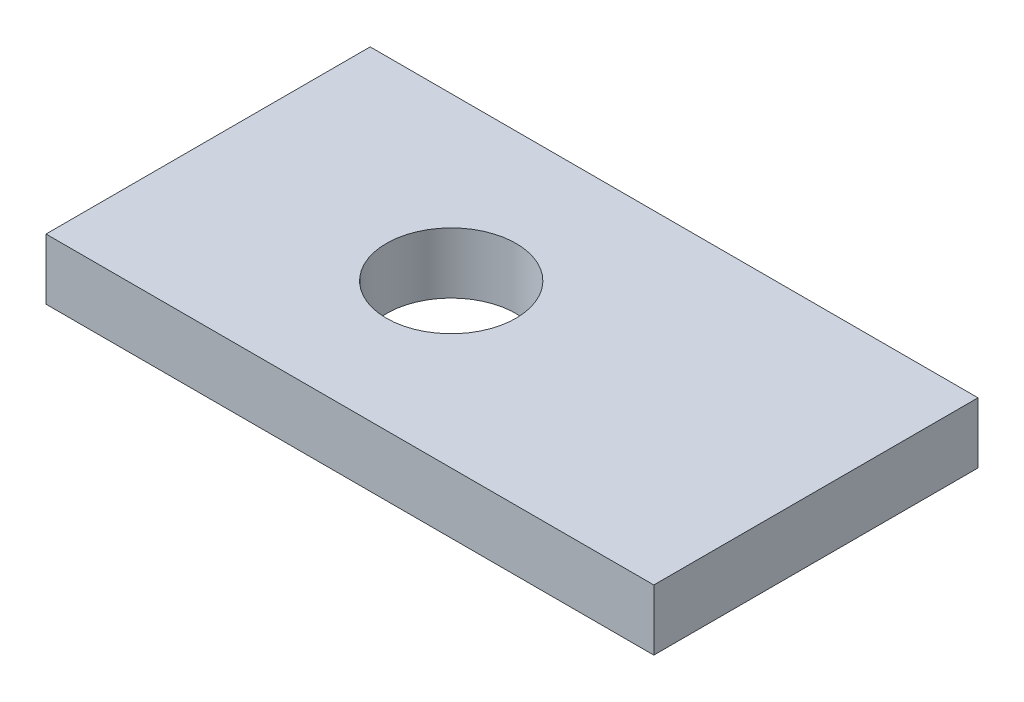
ISO-10303-21;
HEADER;
FILE_DESCRIPTION(('STEP AP214'),'2;1');
FILE_NAME('part.step','',(''),(''),'','','');
FILE_SCHEMA(('AUTOMOTIVE_DESIGN { 1 0 10303 214 1 1 1 1 }'));
ENDSEC;
DATA;
#1=APPLICATION_CONTEXT('core data for automotive mechanical design processes');
#2=APPLICATION_PROTOCOL_DEFINITION('international standard','automotive_design',2000,#1);
#3=PRODUCT_CONTEXT('',#1,'mechanical');
#4=PRODUCT('Part','Part','',(#3));
#5=PRODUCT_RELATED_PRODUCT_CATEGORY('part','',(#4));
#6=PRODUCT_DEFINITION_FORMATION('','',#4);
#7=PRODUCT_DEFINITION_CONTEXT('part definition',#1,'design');
#8=PRODUCT_DEFINITION('design','',#6,#7);
#9=PRODUCT_DEFINITION_SHAPE('','',#8);
#10=(LENGTH_UNIT() NAMED_UNIT(*) SI_UNIT(.MILLI.,.METRE.));
#11=(NAMED_UNIT(*) PLANE_ANGLE_UNIT() SI_UNIT($,.RADIAN.));
#12=(NAMED_UNIT(*) SI_UNIT($,.STERADIAN.) SOLID_ANGLE_UNIT());
#13=UNCERTAINTY_MEASURE_WITH_UNIT(LENGTH_MEASURE(1.E-05),#10,'distance_accuracy_value','');
#14=(GEOMETRIC_REPRESENTATION_CONTEXT(3) GLOBAL_UNCERTAINTY_ASSIGNED_CONTEXT((#13)) GLOBAL_UNIT_ASSIGNED_CONTEXT((#10,
#11,#12)) REPRESENTATION_CONTEXT('',''));
#15=CARTESIAN_POINT('',(0.,0.,0.));
#16=DIRECTION('',(0.,0.,1.));
#17=DIRECTION('',(1.,0.,0.));
#18=AXIS2_PLACEMENT_3D('',#15,#16,#17);
#19=CARTESIAN_POINT('',(0.,-15.,0.));
#20=DIRECTION('',(-1.,0.,0.));
#21=DIRECTION('',(0.,0.,1.));
#22=AXIS2_PLACEMENT_3D('',#19,#20,#21);
#23=PLANE('',#22);
#24=DIRECTION('',(0.,0.,1.));
#25=VECTOR('',#24,1.);
#26=CARTESIAN_POINT('',(0.,0.,0.));
#27=LINE('',#26,#25);
#28=CARTESIAN_POINT('',(0.,0.,-80.));
#29=VERTEX_POINT('',#28);
#30=CARTESIAN_POINT('',(0.,0.,0.));
#31=VERTEX_POINT('',#30);
#32=EDGE_CURVE('E106',#29,#31,#27,.T.);
#33=ORIENTED_EDGE('',*,*,#32,.F.);
#34=DIRECTION('',(0.,1.,0.));
#35=VECTOR('',#34,1.);
#36=CARTESIAN_POINT('',(0.,-15.,-80.));
#37=LINE('',#36,#35);
#38=CARTESIAN_POINT('',(0.,-15.,-80.));
#39=VERTEX_POINT('',#38);
#40=EDGE_CURVE('E11',#39,#29,#37,.T.);
#41=ORIENTED_EDGE('',*,*,#40,.F.);
#42=DIRECTION('',(0.,0.,1.));
#43=VECTOR('',#42,1.);
#44=CARTESIAN_POINT('',(0.,-15.,0.));
#45=LINE('',#44,#43);
#46=CARTESIAN_POINT('',(0.,-15.,0.));
#47=VERTEX_POINT('',#46);
#48=EDGE_CURVE('E97',#39,#47,#45,.T.);
#49=ORIENTED_EDGE('',*,*,#48,.T.);
#50=DIRECTION('',(0.,1.,0.));
#51=VECTOR('',#50,1.);
#52=CARTESIAN_POINT('',(0.,-15.,0.));
#53=LINE('',#52,#51);
#54=EDGE_CURVE('E42',#47,#31,#53,.T.);
#55=ORIENTED_EDGE('',*,*,#54,.T.);
#56=EDGE_LOOP('',(#33,#41,#49,#55));
#57=FACE_BOUND('',#56,.T.);
#58=ADVANCED_FACE('F41',(#57),#23,.T.);
#59=CARTESIAN_POINT('',(0.,-15.,-80.));
#60=DIRECTION('',(0.,0.,-1.));
#61=DIRECTION('',(-1.,0.,0.));
#62=AXIS2_PLACEMENT_3D('',#59,#60,#61);
#63=PLANE('',#62);
#64=DIRECTION('',(-1.,0.,0.));
#65=VECTOR('',#64,1.);
#66=CARTESIAN_POINT('',(0.,0.,-80.));
#67=LINE('',#66,#65);
#68=CARTESIAN_POINT('',(150.,0.,-80.));
#69=VERTEX_POINT('',#68);
#70=EDGE_CURVE('E101',#69,#29,#67,.T.);
#71=ORIENTED_EDGE('',*,*,#70,.F.);
#72=DIRECTION('',(0.,1.,0.));
#73=VECTOR('',#72,1.);
#74=CARTESIAN_POINT('',(150.,-15.,-80.));
#75=LINE('',#74,#73);
#76=CARTESIAN_POINT('',(150.,-15.,-80.));
#77=VERTEX_POINT('',#76);
#78=EDGE_CURVE('E49',#77,#69,#75,.T.);
#79=ORIENTED_EDGE('',*,*,#78,.F.);
#80=DIRECTION('',(-1.,0.,0.));
#81=VECTOR('',#80,1.);
#82=CARTESIAN_POINT('',(0.,-15.,-80.));
#83=LINE('',#82,#81);
#84=EDGE_CURVE('E96',#77,#39,#83,.T.);
#85=ORIENTED_EDGE('',*,*,#84,.T.);
#86=ORIENTED_EDGE('',*,*,#40,.T.);
#87=EDGE_LOOP('',(#71,#79,#85,#86));
#88=FACE_BOUND('',#87,.T.);
#89=ADVANCED_FACE('F119',(#88),#63,.T.);
#90=CARTESIAN_POINT('',(150.,-15.,0.));
#91=DIRECTION('',(1.,0.,0.));
#92=DIRECTION('',(0.,0.,-1.));
#93=AXIS2_PLACEMENT_3D('',#90,#91,#92);
#94=PLANE('',#93);
#95=DIRECTION('',(0.,0.,-1.));
#96=VECTOR('',#95,1.);
#97=CARTESIAN_POINT('',(150.,0.,0.));
#98=LINE('',#97,#96);
#99=CARTESIAN_POINT('',(150.,0.,0.));
#100=VERTEX_POINT('',#99);
#101=EDGE_CURVE('E93',#100,#69,#98,.T.);
#102=ORIENTED_EDGE('',*,*,#101,.F.);
#103=DIRECTION('',(0.,1.,0.));
#104=VECTOR('',#103,1.);
#105=CARTESIAN_POINT('',(150.,-15.,0.));
#106=LINE('',#105,#104);
#107=CARTESIAN_POINT('',(150.,-15.,0.));
#108=VERTEX_POINT('',#107);
#109=EDGE_CURVE('E88',#108,#100,#106,.T.);
#110=ORIENTED_EDGE('',*,*,#109,.F.);
#111=DIRECTION('',(0.,0.,-1.));
#112=VECTOR('',#111,1.);
#113=CARTESIAN_POINT('',(150.,-15.,0.));
#114=LINE('',#113,#112);
#115=EDGE_CURVE('E90',#108,#77,#114,.T.);
#116=ORIENTED_EDGE('',*,*,#115,.T.);
#117=ORIENTED_EDGE('',*,*,#78,.T.);
#118=EDGE_LOOP('',(#102,#110,#116,#117));
#119=FACE_BOUND('',#118,.T.);
#120=ADVANCED_FACE('F86',(#119),#94,.T.);
#121=CARTESIAN_POINT('',(0.,-15.,0.));
#122=DIRECTION('',(0.,0.,1.));
#123=DIRECTION('',(1.,0.,0.));
#124=AXIS2_PLACEMENT_3D('',#121,#122,#123);
#125=PLANE('',#124);
#126=DIRECTION('',(1.,0.,0.));
#127=VECTOR('',#126,1.);
#128=CARTESIAN_POINT('',(0.,0.,0.));
#129=LINE('',#128,#127);
#130=EDGE_CURVE('E108',#31,#100,#129,.T.);
#131=ORIENTED_EDGE('',*,*,#130,.F.);
#132=ORIENTED_EDGE('',*,*,#54,.F.);
#133=DIRECTION('',(1.,0.,0.));
#134=VECTOR('',#133,1.);
#135=CARTESIAN_POINT('',(0.,-15.,0.));
#136=LINE('',#135,#134);
#137=EDGE_CURVE('E92',#47,#108,#136,.T.);
#138=ORIENTED_EDGE('',*,*,#137,.T.);
#139=ORIENTED_EDGE('',*,*,#109,.T.);
#140=EDGE_LOOP('',(#131,#132,#138,#139));
#141=FACE_BOUND('',#140,.T.);
#142=ADVANCED_FACE('F98',(#141),#125,.T.);
#143=CARTESIAN_POINT('',(0.,-15.,0.));
#144=DIRECTION('',(0.,-1.,0.));
#145=DIRECTION('',(0.,0.,-1.));
#146=AXIS2_PLACEMENT_3D('',#143,#144,#145);
#147=PLANE('',#146);
#148=CARTESIAN_POINT('',(60.,-15.,-40.));
#149=DIRECTION('',(0.,1.,0.));
#150=DIRECTION('',(0.,0.,1.));
#151=AXIS2_PLACEMENT_3D('',#148,#149,#150);
#152=CIRCLE('',#151,16.);
#153=CARTESIAN_POINT('',(60.,-15.,-24.));
#154=VERTEX_POINT('',#153);
#155=EDGE_CURVE('E109',#154,#154,#152,.T.);
#156=ORIENTED_EDGE('',*,*,#155,.T.);
#157=EDGE_LOOP('',(#156));
#158=FACE_BOUND('',#157,.T.);
#159=ORIENTED_EDGE('',*,*,#48,.F.);
#160=ORIENTED_EDGE('',*,*,#84,.F.);
#161=ORIENTED_EDGE('',*,*,#115,.F.);
#162=ORIENTED_EDGE('',*,*,#137,.F.);
#163=EDGE_LOOP('',(#159,#160,#161,#162));
#164=FACE_BOUND('',#163,.T.);
#165=ADVANCED_FACE('F94',(#158,#164),#147,.T.);
#166=CARTESIAN_POINT('',(0.,0.,0.));
#167=DIRECTION('',(0.,-1.,0.));
#168=DIRECTION('',(0.,0.,-1.));
#169=AXIS2_PLACEMENT_3D('',#166,#167,#168);
#170=PLANE('',#169);
#171=CARTESIAN_POINT('',(60.,0.,-40.));
#172=DIRECTION('',(0.,1.,0.));
#173=DIRECTION('',(0.,0.,1.));
#174=AXIS2_PLACEMENT_3D('',#171,#172,#173);
#175=CIRCLE('',#174,16.);
#176=CARTESIAN_POINT('',(60.,0.,-24.));
#177=VERTEX_POINT('',#176);
#178=EDGE_CURVE('E150',#177,#177,#175,.T.);
#179=ORIENTED_EDGE('',*,*,#178,.F.);
#180=EDGE_LOOP('',(#179));
#181=FACE_BOUND('',#180,.T.);
#182=ORIENTED_EDGE('',*,*,#32,.T.);
#183=ORIENTED_EDGE('',*,*,#130,.T.);
#184=ORIENTED_EDGE('',*,*,#101,.T.);
#185=ORIENTED_EDGE('',*,*,#70,.T.);
#186=EDGE_LOOP('',(#182,#183,#184,#185));
#187=FACE_BOUND('',#186,.T.);
#188=ADVANCED_FACE('F118',(#181,#187),#170,.F.);
#189=CARTESIAN_POINT('',(60.,-15.,-40.));
#190=DIRECTION('',(0.,1.,0.));
#191=DIRECTION('',(0.,0.,1.));
#192=AXIS2_PLACEMENT_3D('',#189,#190,#191);
#193=CYLINDRICAL_SURFACE('',#192,16.);
#194=ORIENTED_EDGE('',*,*,#155,.F.);
#195=EDGE_LOOP('',(#194));
#196=FACE_BOUND('',#195,.T.);
#197=ORIENTED_EDGE('',*,*,#178,.T.);
#198=EDGE_LOOP('',(#197));
#199=FACE_BOUND('',#198,.T.);
#200=ADVANCED_FACE('F131',(#196,#199),#193,.F.);
#201=CLOSED_SHELL('',(#58,#89,#120,#142,#165,#188,#200));
#202=MANIFOLD_SOLID_BREP('B2',#201);
#203=ADVANCED_BREP_SHAPE_REPRESENTATION('',(#18,#202),#14);
#204=SHAPE_DEFINITION_REPRESENTATION(#9,#203);
ENDSEC;
END-ISO-10303-21;
